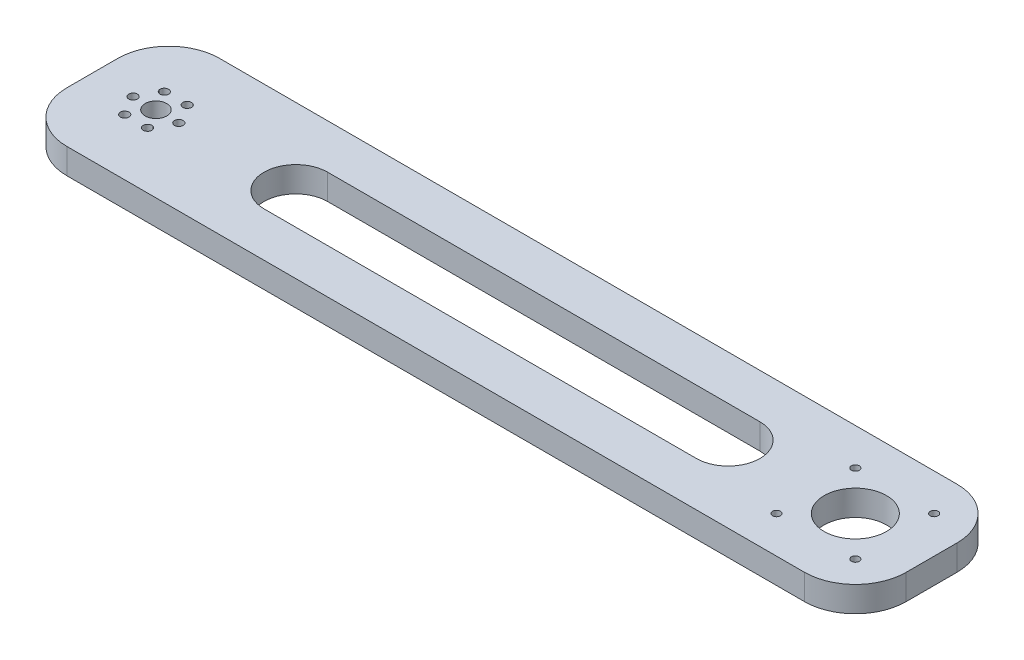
from build123d import *

# Parameters (mm, degrees)
SKETCH_1_W               = 330
SKETCH_1_H               = 60
EXTRUDE_1_DEPTH          = 10
FILLET_1_R               = 20
SKETCH_5_R               = 12.25
CUT_EXTRUDE_3_DEPTH      = 12
SKETCH_9_R               = 1.55
CUT_EXTRUDE_6_DEPTH      = 169.002976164
SKETCH_11_R              = 4.25
CUT_EXTRUDE_8_DEPTH      = 169.002976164
CUT_EXTRUDE_11_DEPTH     = 169.002976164
SKETCH_16_R              = 1.7
CUT_EXTRUDE_12_DEPTH     = 169.002976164
PATTERN_CIRCULAR_1_COUNT = 6


with BuildPart() as part:
    # Sketch 1 → Extrude 1 (new body)
    with BuildSketch(Plane(origin=(0, 0, 0), x_dir=(1, 0, 0), z_dir=(0, 1, 0))):
        Rectangle(SKETCH_1_W, SKETCH_1_H)
    extrude(amount=EXTRUDE_1_DEPTH)

    # Fillet 1
    fillet_1_edges = [part.edges().sort_by_distance(p)[0] for p in [
        (165, 5, 30),
        (-165, 5, 30),
        (-165, 5, -30),
        (165, 5, -30),
    ]]
    fillet(fillet_1_edges, radius=FILLET_1_R)

    # Sketch 5 → Cut-Extrude 3 (cut)
    with BuildSketch(Plane(origin=(0, 10, 0), x_dir=(1, 0, 0), z_dir=(0, 1, 0))):
        with Locations(Location((135, 0, 0), (0, 0, 270))):
            Circle(SKETCH_5_R)
    extrude(amount=-CUT_EXTRUDE_3_DEPTH, mode=Mode.SUBTRACT)

    # Sketch 9 → Cut-Extrude 6 (cut, through all)
    with BuildSketch(Plane.XZ):
        with Locations(Location((119.5, 15.5, 0), (0, 0, 270))):
            Circle(SKETCH_9_R)
        with Locations(Location((150.5, 15.5, 0), (0, 0, 270))):
            Circle(SKETCH_9_R)
        with Locations(Location((150.5, -15.5, 0), (0, 0, 270))):
            Circle(SKETCH_9_R)
        with Locations(Location((119.5, -15.5, 0), (0, 0, 270))):
            Circle(SKETCH_9_R)
    extrude(amount=-CUT_EXTRUDE_6_DEPTH, mode=Mode.SUBTRACT)

    # Sketch 11 → Cut-Extrude 8 (cut, through all)
    with BuildSketch(Plane.XZ):
        with Locations(Location((-140, 0, 0), (0, 0, 270))):
            Circle(SKETCH_11_R)
    extrude(amount=-CUT_EXTRUDE_8_DEPTH, mode=Mode.SUBTRACT)

    # Sketch 15 → Cut-Extrude 11 (cut, through all)
    with BuildSketch(Plane.XZ):
        with BuildLine():
            Line((-85, 12.5), (85, 12.5))
            ThreePointArc((85, 12.5), (97.5, 0), (85, -12.5))
            Line((85, -12.5), (-85, -12.5))
            ThreePointArc((-85, -12.5), (-97.5, 0), (-85, 12.5))
        make_face()
    extrude(amount=-CUT_EXTRUDE_11_DEPTH, mode=Mode.SUBTRACT)

    # Sketch 16 → Cut-Extrude 12 (cut, through all)
    with BuildSketch(Plane.XZ):
        with Locations(Location((-149, 0, 0), (0, 0, 270))):
            Circle(SKETCH_16_R)
    cut_extrude_12 = extrude(amount=-CUT_EXTRUDE_12_DEPTH, mode=Mode.SUBTRACT)

    # Pattern Circular 1: Cut-Extrude 12 ×6 about axis
    pattern_circular_1_axis = Axis((-140, 0, 0), (0, 1, 0))
    for i in range(1, PATTERN_CIRCULAR_1_COUNT):
        add(cut_extrude_12.rotate(pattern_circular_1_axis, i * 360 / PATTERN_CIRCULAR_1_COUNT), mode=Mode.SUBTRACT)


solid = part.part
